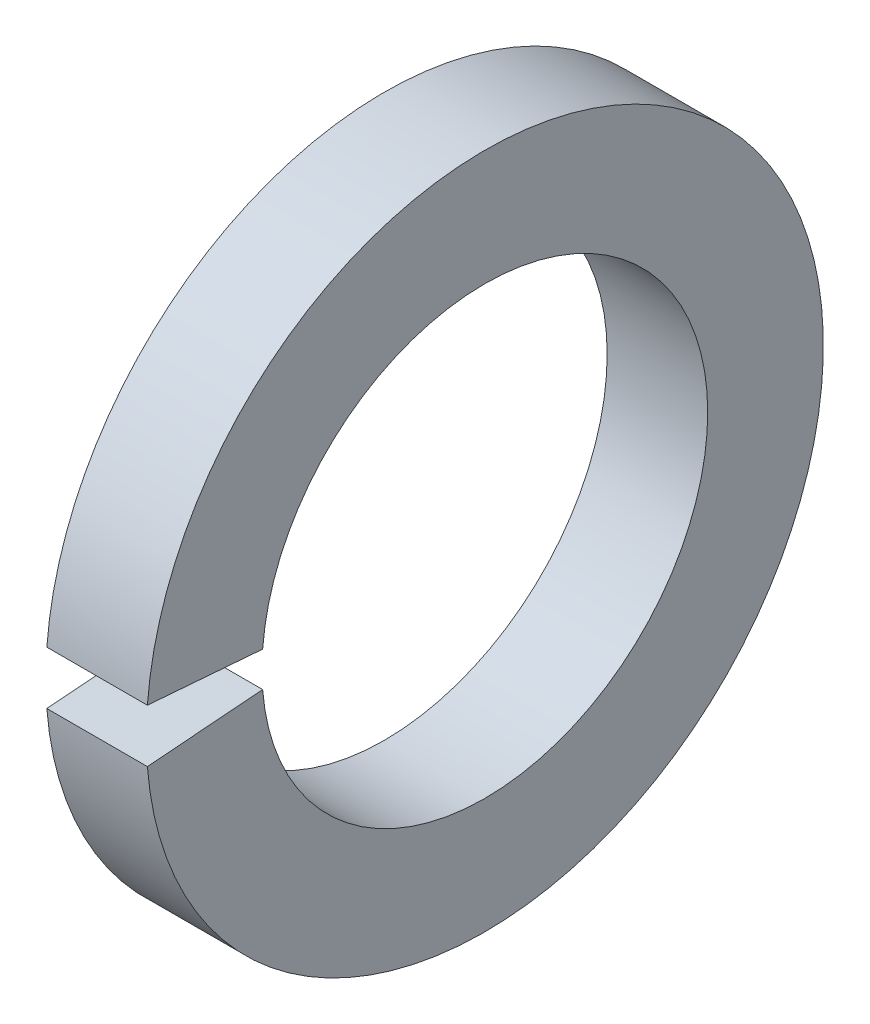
from build123d import *

# Parameters (mm, degrees)
SKETCH1_W = 0.762
SKETCH1_H = 0.8763
GAP_DEPTH = 4.707181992


with BuildPart() as part:
    # Sketch1 → Base-Revolve (revolve)
    with BuildSketch(Plane.XY, mode=Mode.PRIVATE) as base_revolve_sk:
        with Locations((-0.381, 2.12725)):
            Rectangle(SKETCH1_W, SKETCH1_H)
    revolve(base_revolve_sk.sketch.rotate(Axis((-34.925, 0, 0), (1, 0, 0)), 90), axis=Axis((-34.925, 0, 0), (1, 0, 0)))

    # Sketch2 → Gap (cut, through all)
    with BuildSketch(Plane(origin=(0, 0, 0), x_dir=(0, -1, 0), z_dir=(-1, 0, 0))):
        with BuildLine():
            Line((0, 0), (0.205304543, 2.608641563))
            ThreePointArc((0.205304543, 2.608641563), (0, 2.616708), (-0.205304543, 2.608641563))
            Line((-0.205304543, 2.608641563), (0, 0))
        make_face()
    extrude(amount=GAP_DEPTH, mode=Mode.SUBTRACT)


solid = part.part
